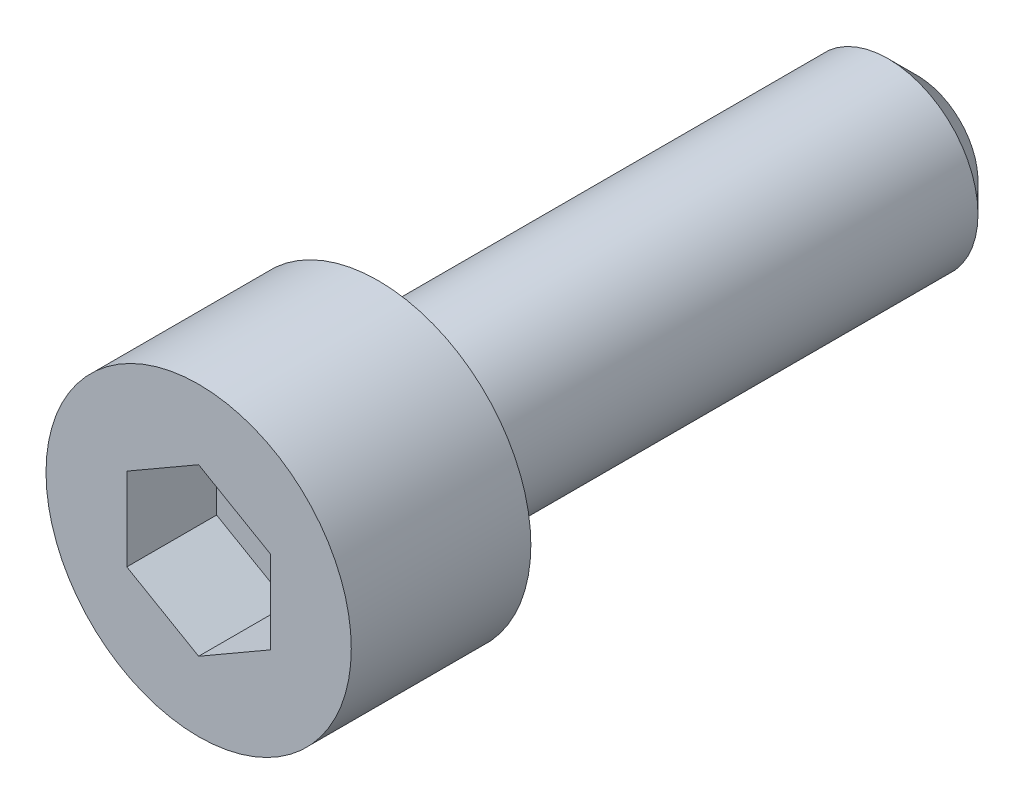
ISO-10303-21;
HEADER;
FILE_DESCRIPTION(('STEP AP214'),'2;1');
FILE_NAME('part.step','',(''),(''),'','','');
FILE_SCHEMA(('AUTOMOTIVE_DESIGN { 1 0 10303 214 1 1 1 1 }'));
ENDSEC;
DATA;
#1=APPLICATION_CONTEXT('core data for automotive mechanical design processes');
#2=APPLICATION_PROTOCOL_DEFINITION('international standard','automotive_design',2000,#1);
#3=PRODUCT_CONTEXT('',#1,'mechanical');
#4=PRODUCT('Part','Part','',(#3));
#5=PRODUCT_RELATED_PRODUCT_CATEGORY('part','',(#4));
#6=PRODUCT_DEFINITION_FORMATION('','',#4);
#7=PRODUCT_DEFINITION_CONTEXT('part definition',#1,'design');
#8=PRODUCT_DEFINITION('design','',#6,#7);
#9=PRODUCT_DEFINITION_SHAPE('','',#8);
#10=(LENGTH_UNIT() NAMED_UNIT(*) SI_UNIT(.MILLI.,.METRE.));
#11=(NAMED_UNIT(*) PLANE_ANGLE_UNIT() SI_UNIT($,.RADIAN.));
#12=(NAMED_UNIT(*) SI_UNIT($,.STERADIAN.) SOLID_ANGLE_UNIT());
#13=UNCERTAINTY_MEASURE_WITH_UNIT(LENGTH_MEASURE(1.E-05),#10,'distance_accuracy_value','');
#14=(GEOMETRIC_REPRESENTATION_CONTEXT(3) GLOBAL_UNCERTAINTY_ASSIGNED_CONTEXT((#13)) GLOBAL_UNIT_ASSIGNED_CONTEXT((#10,
#11,#12)) REPRESENTATION_CONTEXT('',''));
#15=CARTESIAN_POINT('',(0.,0.,0.));
#16=DIRECTION('',(0.,0.,1.));
#17=DIRECTION('',(1.,0.,0.));
#18=AXIS2_PLACEMENT_3D('',#15,#16,#17);
#19=CARTESIAN_POINT('',(0.,2.30940107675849,2.5));
#20=DIRECTION('',(-0.5,-0.86602540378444,0.));
#21=DIRECTION('',(0.86602540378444,-0.5,0.));
#22=AXIS2_PLACEMENT_3D('',#19,#20,#21);
#23=PLANE('',#22);
#24=DIRECTION('',(0.,0.,1.));
#25=VECTOR('',#24,1.);
#26=CARTESIAN_POINT('',(2.,1.15470053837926,2.5));
#27=LINE('',#26,#25);
#28=CARTESIAN_POINT('',(2.,1.15470053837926,2.5));
#29=VERTEX_POINT('',#28);
#30=CARTESIAN_POINT('',(2.,1.15470053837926,5.));
#31=VERTEX_POINT('',#30);
#32=EDGE_CURVE('E63',#29,#31,#27,.T.);
#33=ORIENTED_EDGE('',*,*,#32,.T.);
#34=DIRECTION('',(0.86602540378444,-0.5,0.));
#35=VECTOR('',#34,1.);
#36=CARTESIAN_POINT('',(0.,2.3094010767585,5.));
#37=LINE('',#36,#35);
#38=CARTESIAN_POINT('',(0.,2.3094010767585,5.));
#39=VERTEX_POINT('',#38);
#40=EDGE_CURVE('E29',#39,#31,#37,.T.);
#41=ORIENTED_EDGE('',*,*,#40,.F.);
#42=DIRECTION('',(0.,0.,1.));
#43=VECTOR('',#42,1.);
#44=CARTESIAN_POINT('',(0.,2.30940107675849,2.5));
#45=LINE('',#44,#43);
#46=CARTESIAN_POINT('',(0.,2.30940107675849,2.5));
#47=VERTEX_POINT('',#46);
#48=EDGE_CURVE('E33',#47,#39,#45,.T.);
#49=ORIENTED_EDGE('',*,*,#48,.F.);
#50=DIRECTION('',(0.86602540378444,-0.5,0.));
#51=VECTOR('',#50,1.);
#52=CARTESIAN_POINT('',(0.,2.30940107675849,2.5));
#53=LINE('',#52,#51);
#54=EDGE_CURVE('E65',#47,#29,#53,.T.);
#55=ORIENTED_EDGE('',*,*,#54,.T.);
#56=EDGE_LOOP('',(#33,#41,#49,#55));
#57=FACE_BOUND('',#56,.T.);
#58=ADVANCED_FACE('F14',(#57),#23,.T.);
#59=CARTESIAN_POINT('',(2.,-1.15470053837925,2.5));
#60=DIRECTION('',(1.,0.,0.));
#61=DIRECTION('',(0.,0.,-1.));
#62=AXIS2_PLACEMENT_3D('',#59,#60,#61);
#63=PLANE('',#62);
#64=DIRECTION('',(0.,0.,1.));
#65=VECTOR('',#64,1.);
#66=CARTESIAN_POINT('',(2.,-1.15470053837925,2.5));
#67=LINE('',#66,#65);
#68=CARTESIAN_POINT('',(2.,-1.15470053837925,2.5));
#69=VERTEX_POINT('',#68);
#70=CARTESIAN_POINT('',(2.,-1.15470053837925,5.));
#71=VERTEX_POINT('',#70);
#72=EDGE_CURVE('E70',#69,#71,#67,.T.);
#73=ORIENTED_EDGE('',*,*,#72,.T.);
#74=DIRECTION('',(0.,1.,0.));
#75=VECTOR('',#74,1.);
#76=CARTESIAN_POINT('',(2.,-1.15470053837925,5.));
#77=LINE('',#76,#75);
#78=EDGE_CURVE('E73',#71,#31,#77,.T.);
#79=ORIENTED_EDGE('',*,*,#78,.T.);
#80=ORIENTED_EDGE('',*,*,#32,.F.);
#81=DIRECTION('',(0.,1.,0.));
#82=VECTOR('',#81,1.);
#83=CARTESIAN_POINT('',(2.,-1.15470053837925,2.5));
#84=LINE('',#83,#82);
#85=EDGE_CURVE('E100',#69,#29,#84,.T.);
#86=ORIENTED_EDGE('',*,*,#85,.F.);
#87=EDGE_LOOP('',(#73,#79,#80,#86));
#88=FACE_BOUND('',#87,.T.);
#89=ADVANCED_FACE('F74',(#88),#63,.F.);
#90=CARTESIAN_POINT('',(0.,-2.30940107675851,2.5));
#91=DIRECTION('',(0.5,-0.86602540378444,0.));
#92=DIRECTION('',(0.86602540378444,0.5,0.));
#93=AXIS2_PLACEMENT_3D('',#90,#91,#92);
#94=PLANE('',#93);
#95=DIRECTION('',(0.,0.,1.));
#96=VECTOR('',#95,1.);
#97=CARTESIAN_POINT('',(0.,-2.30940107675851,2.5));
#98=LINE('',#97,#96);
#99=CARTESIAN_POINT('',(0.,-2.30940107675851,2.5));
#100=VERTEX_POINT('',#99);
#101=CARTESIAN_POINT('',(0.,-2.3094010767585,5.));
#102=VERTEX_POINT('',#101);
#103=EDGE_CURVE('E108',#100,#102,#98,.T.);
#104=ORIENTED_EDGE('',*,*,#103,.T.);
#105=DIRECTION('',(0.86602540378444,0.5,0.));
#106=VECTOR('',#105,1.);
#107=CARTESIAN_POINT('',(0.,-2.3094010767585,5.));
#108=LINE('',#107,#106);
#109=EDGE_CURVE('E78',#102,#71,#108,.T.);
#110=ORIENTED_EDGE('',*,*,#109,.T.);
#111=ORIENTED_EDGE('',*,*,#72,.F.);
#112=DIRECTION('',(0.86602540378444,0.5,0.));
#113=VECTOR('',#112,1.);
#114=CARTESIAN_POINT('',(0.,-2.30940107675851,2.5));
#115=LINE('',#114,#113);
#116=EDGE_CURVE('E97',#100,#69,#115,.T.);
#117=ORIENTED_EDGE('',*,*,#116,.F.);
#118=EDGE_LOOP('',(#104,#110,#111,#117));
#119=FACE_BOUND('',#118,.T.);
#120=ADVANCED_FACE('F141',(#119),#94,.F.);
#121=CARTESIAN_POINT('',(0.,-2.30940107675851,2.5));
#122=DIRECTION('',(0.5,0.86602540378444,0.));
#123=DIRECTION('',(-0.86602540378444,0.5,0.));
#124=AXIS2_PLACEMENT_3D('',#121,#122,#123);
#125=PLANE('',#124);
#126=DIRECTION('',(0.,0.,1.));
#127=VECTOR('',#126,1.);
#128=CARTESIAN_POINT('',(-2.,-1.15470053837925,2.5));
#129=LINE('',#128,#127);
#130=CARTESIAN_POINT('',(-2.,-1.15470053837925,2.5));
#131=VERTEX_POINT('',#130);
#132=CARTESIAN_POINT('',(-2.,-1.15470053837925,5.));
#133=VERTEX_POINT('',#132);
#134=EDGE_CURVE('E106',#131,#133,#129,.T.);
#135=ORIENTED_EDGE('',*,*,#134,.T.);
#136=DIRECTION('',(-0.86602540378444,0.5,0.));
#137=VECTOR('',#136,1.);
#138=CARTESIAN_POINT('',(0.,-2.3094010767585,5.));
#139=LINE('',#138,#137);
#140=EDGE_CURVE('E189',#102,#133,#139,.T.);
#141=ORIENTED_EDGE('',*,*,#140,.F.);
#142=ORIENTED_EDGE('',*,*,#103,.F.);
#143=DIRECTION('',(-0.86602540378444,0.5,0.));
#144=VECTOR('',#143,1.);
#145=CARTESIAN_POINT('',(0.,-2.30940107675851,2.5));
#146=LINE('',#145,#144);
#147=EDGE_CURVE('E94',#100,#131,#146,.T.);
#148=ORIENTED_EDGE('',*,*,#147,.T.);
#149=EDGE_LOOP('',(#135,#141,#142,#148));
#150=FACE_BOUND('',#149,.T.);
#151=ADVANCED_FACE('F153',(#150),#125,.T.);
#152=CARTESIAN_POINT('',(-2.,1.15470053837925,2.5));
#153=DIRECTION('',(-1.,0.,0.));
#154=DIRECTION('',(0.,-1.,0.));
#155=AXIS2_PLACEMENT_3D('',#152,#153,#154);
#156=PLANE('',#155);
#157=DIRECTION('',(0.,0.,1.));
#158=VECTOR('',#157,1.);
#159=CARTESIAN_POINT('',(-2.,1.15470053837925,2.5));
#160=LINE('',#159,#158);
#161=CARTESIAN_POINT('',(-2.,1.15470053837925,2.5));
#162=VERTEX_POINT('',#161);
#163=CARTESIAN_POINT('',(-2.,1.15470053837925,5.));
#164=VERTEX_POINT('',#163);
#165=EDGE_CURVE('E104',#162,#164,#160,.T.);
#166=ORIENTED_EDGE('',*,*,#165,.T.);
#167=DIRECTION('',(0.,-1.,0.));
#168=VECTOR('',#167,1.);
#169=CARTESIAN_POINT('',(-2.,1.15470053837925,5.));
#170=LINE('',#169,#168);
#171=EDGE_CURVE('E190',#164,#133,#170,.T.);
#172=ORIENTED_EDGE('',*,*,#171,.T.);
#173=ORIENTED_EDGE('',*,*,#134,.F.);
#174=DIRECTION('',(0.,-1.,0.));
#175=VECTOR('',#174,1.);
#176=CARTESIAN_POINT('',(-2.,1.15470053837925,2.5));
#177=LINE('',#176,#175);
#178=EDGE_CURVE('E91',#162,#131,#177,.T.);
#179=ORIENTED_EDGE('',*,*,#178,.F.);
#180=EDGE_LOOP('',(#166,#172,#173,#179));
#181=FACE_BOUND('',#180,.T.);
#182=ADVANCED_FACE('F149',(#181),#156,.F.);
#183=CARTESIAN_POINT('',(0.,2.30940107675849,2.5));
#184=DIRECTION('',(-0.5,0.86602540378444,0.));
#185=DIRECTION('',(-0.86602540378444,-0.5,0.));
#186=AXIS2_PLACEMENT_3D('',#183,#184,#185);
#187=PLANE('',#186);
#188=DIRECTION('',(-0.86602540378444,-0.5,0.));
#189=VECTOR('',#188,1.);
#190=CARTESIAN_POINT('',(0.,2.30940107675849,2.5));
#191=LINE('',#190,#189);
#192=EDGE_CURVE('E88',#47,#162,#191,.T.);
#193=ORIENTED_EDGE('',*,*,#192,.F.);
#194=ORIENTED_EDGE('',*,*,#48,.T.);
#195=DIRECTION('',(-0.86602540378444,-0.5,0.));
#196=VECTOR('',#195,1.);
#197=CARTESIAN_POINT('',(0.,2.3094010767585,5.));
#198=LINE('',#197,#196);
#199=EDGE_CURVE('E84',#39,#164,#198,.T.);
#200=ORIENTED_EDGE('',*,*,#199,.T.);
#201=ORIENTED_EDGE('',*,*,#165,.F.);
#202=EDGE_LOOP('',(#193,#194,#200,#201));
#203=FACE_BOUND('',#202,.T.);
#204=ADVANCED_FACE('F146',(#203),#187,.F.);
#205=CARTESIAN_POINT('',(-2.,3.46410161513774,2.5));
#206=DIRECTION('',(0.,0.,-1.));
#207=DIRECTION('',(-1.,0.,0.));
#208=AXIS2_PLACEMENT_3D('',#205,#206,#207);
#209=PLANE('',#208);
#210=ORIENTED_EDGE('',*,*,#54,.F.);
#211=ORIENTED_EDGE('',*,*,#192,.T.);
#212=ORIENTED_EDGE('',*,*,#178,.T.);
#213=ORIENTED_EDGE('',*,*,#147,.F.);
#214=ORIENTED_EDGE('',*,*,#116,.T.);
#215=ORIENTED_EDGE('',*,*,#85,.T.);
#216=EDGE_LOOP('',(#210,#211,#212,#213,#214,#215));
#217=FACE_BOUND('',#216,.T.);
#218=ADVANCED_FACE('F145',(#217),#209,.F.);
#219=CARTESIAN_POINT('',(0.,0.,5.));
#220=DIRECTION('',(0.,0.,1.));
#221=DIRECTION('',(1.,0.,0.));
#222=AXIS2_PLACEMENT_3D('',#219,#220,#221);
#223=PLANE('',#222);
#224=CARTESIAN_POINT('',(0.,0.,5.));
#225=DIRECTION('',(0.,0.,1.));
#226=DIRECTION('',(1.,0.,0.));
#227=AXIS2_PLACEMENT_3D('',#224,#225,#226);
#228=CIRCLE('',#227,4.25);
#229=CARTESIAN_POINT('',(4.25,0.,5.));
#230=VERTEX_POINT('',#229);
#231=EDGE_CURVE('E116',#230,#230,#228,.T.);
#232=ORIENTED_EDGE('',*,*,#231,.T.);
#233=EDGE_LOOP('',(#232));
#234=FACE_BOUND('',#233,.T.);
#235=ORIENTED_EDGE('',*,*,#199,.F.);
#236=ORIENTED_EDGE('',*,*,#40,.T.);
#237=ORIENTED_EDGE('',*,*,#78,.F.);
#238=ORIENTED_EDGE('',*,*,#109,.F.);
#239=ORIENTED_EDGE('',*,*,#140,.T.);
#240=ORIENTED_EDGE('',*,*,#171,.F.);
#241=EDGE_LOOP('',(#235,#236,#237,#238,#239,#240));
#242=FACE_BOUND('',#241,.T.);
#243=ADVANCED_FACE('F81',(#234,#242),#223,.T.);
#244=CARTESIAN_POINT('',(0.,0.,5.));
#245=DIRECTION('',(0.,0.,1.));
#246=DIRECTION('',(1.,0.,0.));
#247=AXIS2_PLACEMENT_3D('',#244,#245,#246);
#248=CYLINDRICAL_SURFACE('',#247,4.25);
#249=CARTESIAN_POINT('',(0.,0.,0.));
#250=DIRECTION('',(0.,0.,1.));
#251=DIRECTION('',(1.,0.,0.));
#252=AXIS2_PLACEMENT_3D('',#249,#250,#251);
#253=CIRCLE('',#252,4.25);
#254=CARTESIAN_POINT('',(4.25,0.,0.));
#255=VERTEX_POINT('',#254);
#256=EDGE_CURVE('E113',#255,#255,#253,.T.);
#257=ORIENTED_EDGE('',*,*,#256,.T.);
#258=EDGE_LOOP('',(#257));
#259=FACE_BOUND('',#258,.T.);
#260=ORIENTED_EDGE('',*,*,#231,.F.);
#261=EDGE_LOOP('',(#260));
#262=FACE_BOUND('',#261,.T.);
#263=ADVANCED_FACE('F166',(#259,#262),#248,.T.);
#264=CARTESIAN_POINT('',(4.25,0.,0.));
#265=DIRECTION('',(0.,0.,-1.));
#266=DIRECTION('',(-1.,0.,0.));
#267=AXIS2_PLACEMENT_3D('',#264,#265,#266);
#268=PLANE('',#267);
#269=CARTESIAN_POINT('',(0.,0.,0.));
#270=DIRECTION('',(0.,0.,1.));
#271=DIRECTION('',(1.,0.,0.));
#272=AXIS2_PLACEMENT_3D('',#269,#270,#271);
#273=CIRCLE('',#272,2.5);
#274=CARTESIAN_POINT('',(2.5,0.,0.));
#275=VERTEX_POINT('',#274);
#276=EDGE_CURVE('E69',#275,#275,#273,.T.);
#277=ORIENTED_EDGE('',*,*,#276,.T.);
#278=EDGE_LOOP('',(#277));
#279=FACE_BOUND('',#278,.T.);
#280=ORIENTED_EDGE('',*,*,#256,.F.);
#281=EDGE_LOOP('',(#280));
#282=FACE_BOUND('',#281,.T.);
#283=ADVANCED_FACE('F163',(#279,#282),#268,.T.);
#284=CARTESIAN_POINT('',(0.,0.,5.));
#285=DIRECTION('',(0.,0.,1.));
#286=DIRECTION('',(1.,0.,0.));
#287=AXIS2_PLACEMENT_3D('',#284,#285,#286);
#288=CYLINDRICAL_SURFACE('',#287,2.5);
#289=CARTESIAN_POINT('',(0.,0.,-14.2));
#290=DIRECTION('',(0.,0.,-1.));
#291=DIRECTION('',(-1.,0.,0.));
#292=AXIS2_PLACEMENT_3D('',#289,#290,#291);
#293=CIRCLE('',#292,2.5);
#294=CARTESIAN_POINT('',(-2.5,0.,-14.2));
#295=VERTEX_POINT('',#294);
#296=EDGE_CURVE('E22',#295,#295,#293,.F.);
#297=ORIENTED_EDGE('',*,*,#296,.T.);
#298=EDGE_LOOP('',(#297));
#299=FACE_BOUND('',#298,.T.);
#300=ORIENTED_EDGE('',*,*,#276,.F.);
#301=EDGE_LOOP('',(#300));
#302=FACE_BOUND('',#301,.T.);
#303=ADVANCED_FACE('F121',(#299,#302),#288,.T.);
#304=CARTESIAN_POINT('',(2.5,0.,-15.));
#305=DIRECTION('',(0.,0.,-1.));
#306=DIRECTION('',(-1.,0.,0.));
#307=AXIS2_PLACEMENT_3D('',#304,#305,#306);
#308=PLANE('',#307);
#309=CARTESIAN_POINT('',(0.,0.,-15.));
#310=DIRECTION('',(0.,0.,-1.));
#311=DIRECTION('',(-1.,0.,0.));
#312=AXIS2_PLACEMENT_3D('',#309,#310,#311);
#313=CIRCLE('',#312,1.7);
#314=CARTESIAN_POINT('',(-1.7,0.,-15.));
#315=VERTEX_POINT('',#314);
#316=EDGE_CURVE('E9',#315,#315,#313,.T.);
#317=ORIENTED_EDGE('',*,*,#316,.T.);
#318=EDGE_LOOP('',(#317));
#319=FACE_BOUND('',#318,.T.);
#320=ADVANCED_FACE('F125',(#319),#308,.T.);
#321=CARTESIAN_POINT('',(0.,0.,-14.2));
#322=DIRECTION('',(0.,0.,1.));
#323=DIRECTION('',(1.,0.,0.));
#324=AXIS2_PLACEMENT_3D('',#321,#322,#323);
#325=CONICAL_SURFACE('',#324,2.5,0.78539816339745);
#326=ORIENTED_EDGE('',*,*,#316,.F.);
#327=EDGE_LOOP('',(#326));
#328=FACE_BOUND('',#327,.T.);
#329=ORIENTED_EDGE('',*,*,#296,.F.);
#330=EDGE_LOOP('',(#329));
#331=FACE_BOUND('',#330,.T.);
#332=ADVANCED_FACE('F16',(#328,#331),#325,.T.);
#333=CLOSED_SHELL('',(#58,#89,#120,#151,#182,#204,#218,#243,#263,#283,#303,#320,#332));
#334=MANIFOLD_SOLID_BREP('B1',#333);
#335=ADVANCED_BREP_SHAPE_REPRESENTATION('',(#18,#334),#14);
#336=SHAPE_DEFINITION_REPRESENTATION(#9,#335);
ENDSEC;
END-ISO-10303-21;
